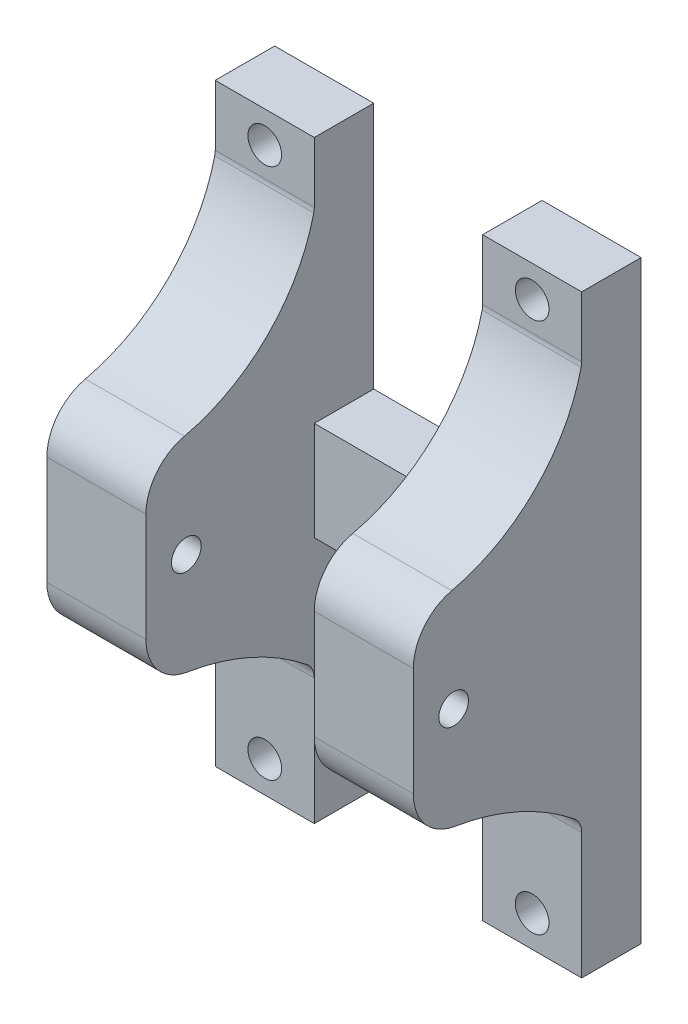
from build123d import *

# Parameters (mm, degrees)
BOSS_EXTRUDE1_DEPTH     = 6
SKETCH3_R               = 1.5
BOSS_EXTRUDE2_DEPTH     = 10
SKETCH4_R               = 1.7
CUT_EXTRUDE1_DEPTH      = 10
MIRROR3_COPY_1_SKETCH_R = 1.7
MIRROR3_COPY_1_DEPTH    = 10
FILLET1_R               = 5
FILLET2_R               = 2


with BuildPart() as part:
    # Sketch1 → Boss-Extrude1 (new body)
    with BuildSketch(Plane.XY):
        Polygon((-8.5, -5), (-8.5, -30), (-18.5, -30), (-18.5, 30), (-8.5, 30), (-8.5, 5), (8.5, 5), (8.5, 30), (18.5, 30), (18.5, -30), (8.5, -30), (8.5, -5), align=None)
    extrude(amount=BOSS_EXTRUDE1_DEPTH)

    # Sketch3 → Boss-Extrude2 (add)
    with BuildSketch(Plane.ZY.offset(18.5)):
        with BuildLine():
            Line((23, 10), (23, -10))
            ThreePointArc((23, -10), (13.928690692, -11.63569966), (6, -16.336766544))
            Line((6, -16.336766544), (6, 23.663233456))
            ThreePointArc((6, 23.663233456), (12.094910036, 13.839167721), (23, 10))
        make_face()
        with Locations(Location((18.926186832, 0, 0), (0, 0, 270))):
            Circle(SKETCH3_R, mode=Mode.SUBTRACT)
    boss_extrude2 = extrude(amount=-BOSS_EXTRUDE2_DEPTH)

    # Sketch4 → Cut-Extrude1 (cut)
    with BuildSketch(Plane.XY.offset(6)):
        with Locations((-13.5, 26.831616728)):
            Circle(SKETCH4_R)
    cut_extrude1 = extrude(amount=-CUT_EXTRUDE1_DEPTH, mode=Mode.SUBTRACT)

    # Mirror2: Cut-Extrude1 across plane
    add(cut_extrude1.mirror(Plane(origin=(0, 0, 0), x_dir=(0, 0, 1), z_dir=(1, 0, 0))), mode=Mode.SUBTRACT)

    # Mirror3: Cut-Extrude1 across plane
    add(cut_extrude1.mirror(Plane.ZX), mode=Mode.SUBTRACT)

    # Mirror3 copy 1 sketch → Mirror3 copy 1 (cut)
    with BuildSketch(Plane(origin=(0, 0, 6), x_dir=(-1, 0, 0), z_dir=(0, 0, 1))):
        with Locations((-13.5, 26.831616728)):
            Circle(MIRROR3_COPY_1_SKETCH_R)
    extrude(amount=-MIRROR3_COPY_1_DEPTH, mode=Mode.SUBTRACT)

    # Mirror4: Boss-Extrude2 across plane
    add(boss_extrude2.mirror(Plane(origin=(0, 0, 0), x_dir=(0, 0, 1), z_dir=(1, 0, 0))))

    # Fillet1
    fillet1_edges = [part.edges().sort_by_distance(p)[0] for p in [
        (-13.5, 10, 23),
        (-13.5, -10, 23),
        (13.5, 10, 23),
        (13.5, -10, 23),
    ]]
    fillet(fillet1_edges, radius=FILLET1_R)

    # Fillet2
    fillet2_edges = [part.edges().sort_by_distance(p)[0] for p in [
        (-13.5, 23.663233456, 6),
        (-13.5, -16.336766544, 6),
        (13.5, 23.663233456, 6),
        (13.5, -16.336766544, 6),
    ]]
    fillet(fillet2_edges, radius=FILLET2_R)


solid = part.part
